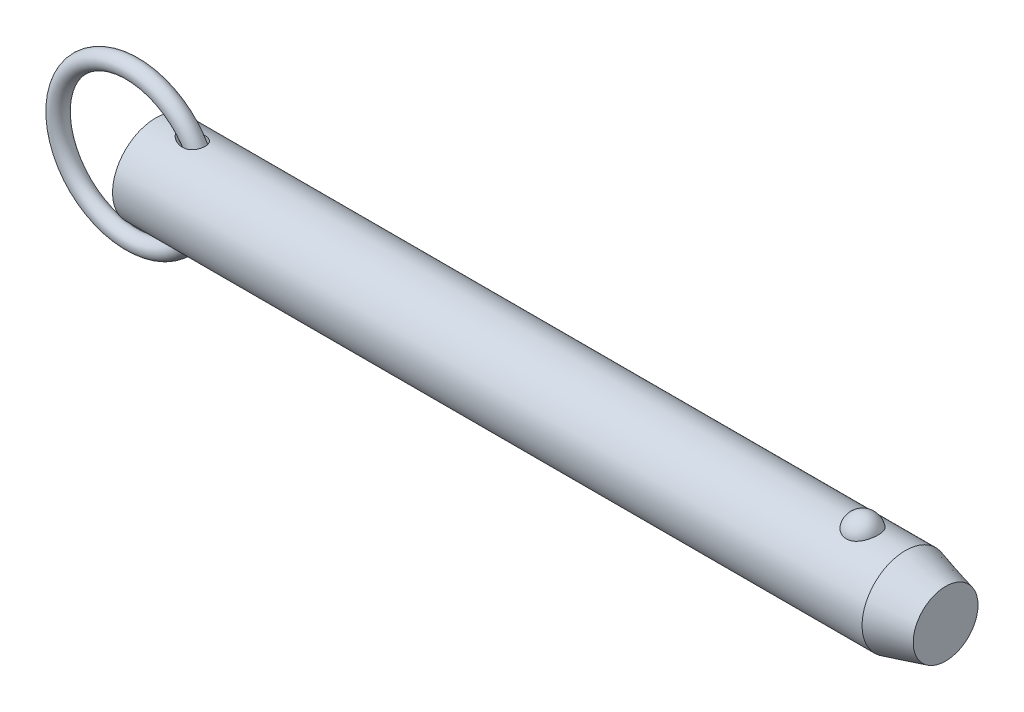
ISO-10303-21;
HEADER;
FILE_DESCRIPTION(('STEP AP214'),'2;1');
FILE_NAME('part.step','',(''),(''),'','','');
FILE_SCHEMA(('AUTOMOTIVE_DESIGN { 1 0 10303 214 1 1 1 1 }'));
ENDSEC;
DATA;
#1=APPLICATION_CONTEXT('core data for automotive mechanical design processes');
#2=APPLICATION_PROTOCOL_DEFINITION('international standard','automotive_design',2000,#1);
#3=PRODUCT_CONTEXT('',#1,'mechanical');
#4=PRODUCT('Part','Part','',(#3));
#5=PRODUCT_RELATED_PRODUCT_CATEGORY('part','',(#4));
#6=PRODUCT_DEFINITION_FORMATION('','',#4);
#7=PRODUCT_DEFINITION_CONTEXT('part definition',#1,'design');
#8=PRODUCT_DEFINITION('design','',#6,#7);
#9=PRODUCT_DEFINITION_SHAPE('','',#8);
#10=(LENGTH_UNIT() NAMED_UNIT(*) SI_UNIT(.MILLI.,.METRE.));
#11=(NAMED_UNIT(*) PLANE_ANGLE_UNIT() SI_UNIT($,.RADIAN.));
#12=(NAMED_UNIT(*) SI_UNIT($,.STERADIAN.) SOLID_ANGLE_UNIT());
#13=UNCERTAINTY_MEASURE_WITH_UNIT(LENGTH_MEASURE(1.E-05),#10,'distance_accuracy_value','');
#14=(GEOMETRIC_REPRESENTATION_CONTEXT(3) GLOBAL_UNCERTAINTY_ASSIGNED_CONTEXT((#13)) GLOBAL_UNIT_ASSIGNED_CONTEXT((#10,
#11,#12)) REPRESENTATION_CONTEXT('',''));
#15=CARTESIAN_POINT('',(0.,0.,0.));
#16=DIRECTION('',(0.,0.,1.));
#17=DIRECTION('',(1.,0.,0.));
#18=AXIS2_PLACEMENT_3D('',#15,#16,#17);
#19=CARTESIAN_POINT('',(-6.08699288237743,0.,0.));
#20=DIRECTION('',(0.,0.,1.));
#21=DIRECTION('',(1.,0.,0.));
#22=AXIS2_PLACEMENT_3D('',#19,#20,#21);
#23=TOROIDAL_SURFACE('',#22,19.05,2.223);
#24=CARTESIAN_POINT('',(15.1860071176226,0.,0.));
#25=VERTEX_POINT('',#24);
#26=VERTEX_LOOP('',#25);
#27=FACE_BOUND('',#26,.T.);
#28=ADVANCED_FACE('P0_F12',(#27),#23,.T.);
#29=CLOSED_SHELL('',(#28));
#30=MANIFOLD_SOLID_BREP('P0_B1',#29);
#31=CARTESIAN_POINT('',(0.,0.,0.));
#32=DIRECTION('',(1.,0.,0.));
#33=DIRECTION('',(0.,0.,-1.));
#34=AXIS2_PLACEMENT_3D('',#31,#32,#33);
#35=CYLINDRICAL_SURFACE('',#34,11.115);
#36=CARTESIAN_POINT('',(6.41405181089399,11.0227946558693,-1.4287136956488));
#37=CARTESIAN_POINT('',(6.49338916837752,11.0115377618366,-1.51556642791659));
#38=CARTESIAN_POINT('',(6.5776546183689,10.9998263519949,-1.59789397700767));
#39=CARTESIAN_POINT('',(6.75386647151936,10.9760304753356,-1.75391400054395));
#40=CARTESIAN_POINT('',(6.84582247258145,10.9639455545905,-1.82759540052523));
#41=CARTESIAN_POINT('',(7.03627827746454,10.9397989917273,-1.96698954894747));
#42=CARTESIAN_POINT('',(7.1348083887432,10.9277377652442,-2.03266078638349));
#43=CARTESIAN_POINT('',(7.33681032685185,10.9041015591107,-2.1558582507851));
#44=CARTESIAN_POINT('',(7.44028007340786,10.8925263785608,-2.21338786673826));
#45=CARTESIAN_POINT('',(7.64386117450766,10.8710104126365,-2.31666528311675));
#46=CARTESIAN_POINT('',(7.74368989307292,10.8610119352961,-2.36295942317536));
#47=CARTESIAN_POINT('',(7.94637195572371,10.8420168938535,-2.44863486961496));
#48=CARTESIAN_POINT('',(8.0492261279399,10.8330206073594,-2.48801426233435));
#49=CARTESIAN_POINT('',(8.3611557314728,10.807980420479,-2.59542730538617));
#50=CARTESIAN_POINT('',(8.57411849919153,10.7938278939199,-2.65299817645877));
#51=CARTESIAN_POINT('',(9.00825016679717,10.7725818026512,-2.73800108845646));
#52=CARTESIAN_POINT('',(9.22947335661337,10.7655491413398,-2.76517330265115));
#53=CARTESIAN_POINT('',(9.6736814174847,10.7605872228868,-2.78445308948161));
#54=CARTESIAN_POINT('',(9.89666486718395,10.7626512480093,-2.77658653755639));
#55=CARTESIAN_POINT('',(10.2950172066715,10.7754452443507,-2.72644436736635));
#56=CARTESIAN_POINT('',(10.4712789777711,10.7844280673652,-2.69109376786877));
#57=CARTESIAN_POINT('',(10.7292776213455,10.8024982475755,-2.61722365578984));
#58=CARTESIAN_POINT('',(10.8142337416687,10.8092901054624,-2.58911576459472));
#59=CARTESIAN_POINT('',(10.9813218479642,10.8242580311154,-2.52581287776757));
#60=CARTESIAN_POINT('',(11.0634550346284,10.8324335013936,-2.49062094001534));
#61=CARTESIAN_POINT('',(11.2247418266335,10.8500287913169,-2.41281958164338));
#62=CARTESIAN_POINT('',(11.3038694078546,10.8594572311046,-2.37015806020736));
#63=CARTESIAN_POINT('',(11.4576781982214,10.8792243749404,-2.27770403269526));
#64=CARTESIAN_POINT('',(11.5323615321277,10.8895626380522,-2.22791497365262));
#65=CARTESIAN_POINT('',(11.6765388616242,10.9108113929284,-2.12140590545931));
#66=CARTESIAN_POINT('',(11.7460329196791,10.9217218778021,-2.06468597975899));
#67=CARTESIAN_POINT('',(11.8790597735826,10.9437207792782,-1.94471764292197));
#68=CARTESIAN_POINT('',(11.9425932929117,10.9548091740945,-1.88147002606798));
#69=CARTESIAN_POINT('',(12.109388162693,10.9851999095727,-1.69784918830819));
#70=CARTESIAN_POINT('',(12.205655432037,11.0042655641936,-1.57093023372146));
#71=CARTESIAN_POINT('',(12.374151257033,11.0393391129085,-1.3017676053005));
#72=CARTESIAN_POINT('',(12.4463875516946,11.0553479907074,-1.15952888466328));
#73=CARTESIAN_POINT('',(12.5615818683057,11.0816338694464,-0.871972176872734));
#74=CARTESIAN_POINT('',(12.6058896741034,11.0921698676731,-0.727217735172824));
#75=CARTESIAN_POINT('',(12.6699315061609,11.1075802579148,-0.432089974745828));
#76=CARTESIAN_POINT('',(12.6896681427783,11.1124552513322,-0.281717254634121));
#77=CARTESIAN_POINT('',(12.704022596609,11.1159901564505,0.0188164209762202));
#78=CARTESIAN_POINT('',(12.6988836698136,11.1147102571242,0.168965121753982));
#79=CARTESIAN_POINT('',(12.6641681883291,11.1062126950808,0.466238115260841));
#80=CARTESIAN_POINT('',(12.6345920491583,11.0989951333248,0.61336245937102));
#81=CARTESIAN_POINT('',(12.5517453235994,11.0794095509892,0.900330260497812));
#82=CARTESIAN_POINT('',(12.4984878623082,11.0670443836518,1.0401777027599));
#83=CARTESIAN_POINT('',(12.3696588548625,11.0385082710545,1.308745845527));
#84=CARTESIAN_POINT('',(12.2940887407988,11.0223375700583,1.43746725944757));
#85=CARTESIAN_POINT('',(12.122380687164,10.987872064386,1.68079704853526));
#86=CARTESIAN_POINT('',(12.0261637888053,10.969569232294,1.79534850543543));
#87=CARTESIAN_POINT('',(11.8161707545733,10.932836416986,2.00695695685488));
#88=CARTESIAN_POINT('',(11.7023941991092,10.9144064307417,2.10401353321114));
#89=CARTESIAN_POINT('',(11.4575656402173,10.8788057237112,2.28105326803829));
#90=CARTESIAN_POINT('',(11.3261451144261,10.8616794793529,2.36053412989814));
#91=CARTESIAN_POINT('',(11.0523589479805,10.8308019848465,2.49839044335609));
#92=CARTESIAN_POINT('',(10.9099908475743,10.8170514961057,2.55676113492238));
#93=CARTESIAN_POINT('',(10.6060622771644,10.7929728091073,2.65666105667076));
#94=CARTESIAN_POINT('',(10.4438877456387,10.7830209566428,2.69640163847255));
#95=CARTESIAN_POINT('',(10.1154037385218,10.7687230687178,2.75293129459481));
#96=CARTESIAN_POINT('',(9.94909141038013,10.7643810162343,2.76970406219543));
#97=CARTESIAN_POINT('',(9.54387061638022,10.7604809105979,2.7848723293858));
#98=CARTESIAN_POINT('',(9.30446860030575,10.7637793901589,2.77227753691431));
#99=CARTESIAN_POINT('',(8.94961255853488,10.7757341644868,2.72524141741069));
#100=CARTESIAN_POINT('',(8.83186896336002,10.7808994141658,2.70482239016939));
#101=CARTESIAN_POINT('',(8.59835142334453,10.7932548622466,2.65509992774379));
#102=CARTESIAN_POINT('',(8.48257728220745,10.8004448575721,2.62579738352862));
#103=CARTESIAN_POINT('',(8.25208469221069,10.8166382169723,2.55827624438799));
#104=CARTESIAN_POINT('',(8.1374021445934,10.8256649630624,2.51994155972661));
#105=CARTESIAN_POINT('',(7.91132058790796,10.8451170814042,2.43486475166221));
#106=CARTESIAN_POINT('',(7.79992154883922,10.8555424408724,2.38812270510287));
#107=CARTESIAN_POINT('',(7.58115677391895,10.8774251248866,2.28638483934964));
#108=CARTESIAN_POINT('',(7.47378802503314,10.8888816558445,2.23139534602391));
#109=CARTESIAN_POINT('',(7.26385624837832,10.9124540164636,2.11310265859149));
#110=CARTESIAN_POINT('',(7.16129168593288,10.9245696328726,2.04980214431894));
#111=CARTESIAN_POINT('',(6.91882218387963,10.9543689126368,1.88540538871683));
#112=CARTESIAN_POINT('',(6.78193778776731,10.9721958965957,1.77979827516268));
#113=CARTESIAN_POINT('',(6.52472441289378,11.0070222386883,1.54989693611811));
#114=CARTESIAN_POINT('',(6.40436902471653,11.0240228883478,1.42563320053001));
#115=CARTESIAN_POINT('',(6.21838804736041,11.0509658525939,1.19529359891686));
#116=CARTESIAN_POINT('',(6.14691885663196,11.0615430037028,1.09404520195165));
#117=CARTESIAN_POINT('',(6.0204349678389,11.0805004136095,0.881508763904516));
#118=CARTESIAN_POINT('',(5.96539400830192,11.0888841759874,0.770237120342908));
#119=CARTESIAN_POINT('',(5.88475453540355,11.1012553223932,0.560577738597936));
#120=CARTESIAN_POINT('',(5.85559643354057,11.1057686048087,0.463603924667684));
#121=CARTESIAN_POINT('',(5.81381299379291,11.1122523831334,0.266083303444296));
#122=CARTESIAN_POINT('',(5.80117118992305,11.1142254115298,0.165540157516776));
#123=CARTESIAN_POINT('',(5.79363815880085,11.1153999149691,-0.0364747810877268));
#124=CARTESIAN_POINT('',(5.79878799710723,11.1145949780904,-0.137948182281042));
#125=CARTESIAN_POINT('',(5.82639592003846,11.1102987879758,-0.338493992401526));
#126=CARTESIAN_POINT('',(5.8488723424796,11.1068046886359,-0.437563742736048));
#127=CARTESIAN_POINT('',(5.91510741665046,11.0965857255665,-0.649968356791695));
#128=CARTESIAN_POINT('',(5.96220905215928,11.0893566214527,-0.7622229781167));
#129=CARTESIAN_POINT('',(6.0737844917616,11.072471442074,-0.977396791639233));
#130=CARTESIAN_POINT('',(6.13826787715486,11.0628140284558,-1.08031079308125));
#131=CARTESIAN_POINT('',(6.24101077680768,11.0477136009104,-1.2219580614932));
#132=CARTESIAN_POINT('',(6.27403486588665,11.042895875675,-1.26469183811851));
#133=CARTESIAN_POINT('',(6.34238022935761,11.0330152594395,-1.34817011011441));
#134=CARTESIAN_POINT('',(6.37769867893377,11.0279526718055,-1.38891694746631));
#135=CARTESIAN_POINT('',(6.41405181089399,11.0227946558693,-1.4287136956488));
#136=B_SPLINE_CURVE_WITH_KNOTS('',3,(#36,#37,#38,#39,#40,#41,#42,#43,#44,#45,#46,#47,#48,#49,
#50,#51,#52,#53,#54,#55,#56,#57,#58,#59,#60,#61,#62,#63,#64,#65,#66,#67,#68,#69,#70,#71,#72,#73,
#74,#75,#76,#77,#78,#79,#80,#81,#82,#83,#84,#85,#86,#87,#88,#89,#90,#91,#92,#93,#94,#95,#96,#97,
#98,#99,#100,#101,#102,#103,#104,#105,#106,#107,#108,#109,#110,#111,#112,#113,#114,#115,#116,
#117,#118,#119,#120,#121,#122,#123,#124,#125,#126,#127,#128,#129,#130,#131,#132,#133,#134,#135),
.UNSPECIFIED.,.T.,.F.,(4,2,2,2,2,2,2,2,2,2,2,2,2,2,2,2,2,2,2,2,2,2,2,2,2,2,2,2,2,2,2,2,2,2,2,2,
2,2,2,2,2,2,2,2,2,2,2,2,2,4),(0.,0.354433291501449,0.709315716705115,1.0659654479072,
1.42246628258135,1.75367157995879,2.08496839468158,2.74582009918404,3.41227815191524,
4.07824412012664,4.61583787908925,4.88478112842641,5.1536085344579,5.42439170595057,
5.69504436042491,5.96569375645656,6.23631025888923,6.71490729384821,7.19335005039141,
7.64641437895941,8.09943057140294,8.54802575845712,8.99661331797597,9.44495256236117,
9.89326303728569,10.3433195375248,10.7933867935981,11.2550086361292,11.7167345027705,
12.2165866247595,12.7167934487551,13.4318876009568,13.7904664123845,14.1490092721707,
14.5124394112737,14.8758662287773,15.239015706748,15.6020483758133,16.1219860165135,
16.6410830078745,17.0130520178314,17.3844231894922,17.6872330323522,17.9897407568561,
18.2929471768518,18.5964749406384,18.9603532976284,19.3244326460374,19.4870338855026,
19.649438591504),.UNSPECIFIED.);
#137=CARTESIAN_POINT('',(6.41405181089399,11.0227946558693,-1.4287136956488));
#138=VERTEX_POINT('',#137);
#139=EDGE_CURVE('P1_E40',#138,#138,#136,.T.);
#140=ORIENTED_EDGE('',*,*,#139,.T.);
#141=EDGE_LOOP('',(#140));
#142=FACE_BOUND('',#141,.T.);
#143=CARTESIAN_POINT('',(192.829563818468,0.,0.));
#144=DIRECTION('',(1.,0.,0.));
#145=DIRECTION('',(0.,0.,-1.));
#146=AXIS2_PLACEMENT_3D('',#143,#144,#145);
#147=CIRCLE('',#146,11.115);
#148=CARTESIAN_POINT('',(192.829563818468,0.,-11.115));
#149=VERTEX_POINT('',#148);
#150=EDGE_CURVE('P1_E25',#149,#149,#147,.T.);
#151=ORIENTED_EDGE('',*,*,#150,.F.);
#152=EDGE_LOOP('',(#151));
#153=FACE_BOUND('',#152,.T.);
#154=CARTESIAN_POINT('',(0.,0.,0.));
#155=DIRECTION('',(1.,0.,0.));
#156=DIRECTION('',(0.,0.,-1.));
#157=AXIS2_PLACEMENT_3D('',#154,#155,#156);
#158=CIRCLE('',#157,11.115);
#159=CARTESIAN_POINT('',(0.,0.,-11.115));
#160=VERTEX_POINT('',#159);
#161=EDGE_CURVE('P1_E9',#160,#160,#158,.T.);
#162=ORIENTED_EDGE('',*,*,#161,.T.);
#163=EDGE_LOOP('',(#162));
#164=FACE_BOUND('',#163,.T.);
#165=CARTESIAN_POINT('',(181.831068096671,10.3028087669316,4.17077409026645));
#166=CARTESIAN_POINT('',(181.614775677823,10.3028003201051,4.17078240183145));
#167=CARTESIAN_POINT('',(181.398548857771,10.3098895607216,4.15340593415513));
#168=CARTESIAN_POINT('',(180.972540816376,10.3373834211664,4.08449540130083));
#169=CARTESIAN_POINT('',(180.762757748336,10.3577841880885,4.0329712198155));
#170=CARTESIAN_POINT('',(180.355782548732,10.4095237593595,3.89746513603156));
#171=CARTESIAN_POINT('',(180.158572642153,10.4408466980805,3.81353029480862));
#172=CARTESIAN_POINT('',(179.781338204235,10.5110236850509,3.61560339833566));
#173=CARTESIAN_POINT('',(179.601317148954,10.5498792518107,3.50160528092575));
#174=CARTESIAN_POINT('',(179.257684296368,10.6322884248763,3.24292464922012));
#175=CARTESIAN_POINT('',(179.094686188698,10.6759443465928,3.0974604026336));
#176=CARTESIAN_POINT('',(178.794591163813,10.7625291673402,2.78171925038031));
#177=CARTESIAN_POINT('',(178.657499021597,10.8054579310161,2.61143778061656));
#178=CARTESIAN_POINT('',(178.406408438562,10.8881935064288,2.24226695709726));
#179=CARTESIAN_POINT('',(178.293710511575,10.9277761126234,2.04244123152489));
#180=CARTESIAN_POINT('',(178.101777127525,10.997484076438,1.62578254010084));
#181=CARTESIAN_POINT('',(178.022544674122,11.0276085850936,1.40894804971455));
#182=CARTESIAN_POINT('',(177.898303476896,11.0756732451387,0.961250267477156));
#183=CARTESIAN_POINT('',(177.853760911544,11.0934470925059,0.730239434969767));
#184=CARTESIAN_POINT('',(177.801569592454,11.1143331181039,0.26343964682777));
#185=CARTESIAN_POINT('',(177.793920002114,11.1174456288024,0.0276507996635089));
#186=CARTESIAN_POINT('',(177.81561056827,11.1087161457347,-0.440729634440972));
#187=CARTESIAN_POINT('',(177.844762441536,11.0969502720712,-0.6733313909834));
#188=CARTESIAN_POINT('',(177.939143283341,11.0597872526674,-1.12996621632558));
#189=CARTESIAN_POINT('',(178.004372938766,11.0343898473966,-1.35399912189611));
#190=CARTESIAN_POINT('',(178.16969844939,10.972515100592,-1.78750286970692));
#191=CARTESIAN_POINT('',(178.26983863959,10.9360236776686,-1.99695478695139));
#192=CARTESIAN_POINT('',(178.502940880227,10.8557595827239,-2.3952066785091));
#193=CARTESIAN_POINT('',(178.635905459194,10.8119863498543,-2.5840050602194));
#194=CARTESIAN_POINT('',(178.932407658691,10.7216733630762,-2.93635726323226));
#195=CARTESIAN_POINT('',(179.096056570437,10.675123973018,-3.09981510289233));
#196=CARTESIAN_POINT('',(179.449860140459,10.5846571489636,-3.39592247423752));
#197=CARTESIAN_POINT('',(179.640012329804,10.5407394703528,-3.52857487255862));
#198=CARTESIAN_POINT('',(180.03750141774,10.4616690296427,-3.75646057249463));
#199=CARTESIAN_POINT('',(180.24436705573,10.4263443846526,-3.85245432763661));
#200=CARTESIAN_POINT('',(180.672954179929,10.3675574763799,-4.00798747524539));
#201=CARTESIAN_POINT('',(180.894670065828,10.344090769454,-4.0675405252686));
#202=CARTESIAN_POINT('',(181.334669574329,10.3128282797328,-4.14614314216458));
#203=CARTESIAN_POINT('',(181.552565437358,10.3043040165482,-4.1670783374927));
#204=CARTESIAN_POINT('',(181.98894951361,10.3016771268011,-4.17357158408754));
#205=CARTESIAN_POINT('',(182.207437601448,10.3075716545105,-4.15913661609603));
#206=CARTESIAN_POINT('',(182.631744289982,10.3326686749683,-4.09636961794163));
#207=CARTESIAN_POINT('',(182.837745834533,10.3514555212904,-4.0490957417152));
#208=CARTESIAN_POINT('',(183.238576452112,10.399818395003,-3.92320197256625));
#209=CARTESIAN_POINT('',(183.4334046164,10.4293952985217,-3.84457953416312));
#210=CARTESIAN_POINT('',(183.811191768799,10.4969600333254,-3.65612410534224));
#211=CARTESIAN_POINT('',(183.993797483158,10.5351178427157,-3.54564545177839));
#212=CARTESIAN_POINT('',(184.338204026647,10.6154999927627,-3.29718036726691));
#213=CARTESIAN_POINT('',(184.500000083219,10.657725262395,-3.15918764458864));
#214=CARTESIAN_POINT('',(184.806959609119,10.744212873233,-2.85163580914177));
#215=CARTESIAN_POINT('',(184.950891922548,10.7884718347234,-2.68084605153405));
#216=CARTESIAN_POINT('',(185.209237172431,10.872374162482,-2.31721864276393));
#217=CARTESIAN_POINT('',(185.323644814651,10.9120167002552,-2.12437704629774));
#218=CARTESIAN_POINT('',(185.523873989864,10.9838919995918,-1.71516999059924));
#219=CARTESIAN_POINT('',(185.60866178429,11.0158465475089,-1.49824866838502));
#220=CARTESIAN_POINT('',(185.74268382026,11.0673523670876,-1.05228572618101));
#221=CARTESIAN_POINT('',(185.791917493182,11.086903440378,-0.823243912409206));
#222=CARTESIAN_POINT('',(185.853891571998,11.1116323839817,-0.359087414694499));
#223=CARTESIAN_POINT('',(185.866566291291,11.1167843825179,-0.123962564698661));
#224=CARTESIAN_POINT('',(185.854973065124,11.1121144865,0.345220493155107));
#225=CARTESIAN_POINT('',(185.830705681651,11.1022928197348,0.57927871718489));
#226=CARTESIAN_POINT('',(185.745907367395,11.0687504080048,1.03866534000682));
#227=CARTESIAN_POINT('',(185.685529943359,11.0450885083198,1.26402641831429));
#228=CARTESIAN_POINT('',(185.529853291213,10.9863185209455,1.70076772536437));
#229=CARTESIAN_POINT('',(185.434551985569,10.9512097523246,1.91214712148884));
#230=CARTESIAN_POINT('',(185.210397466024,10.8729733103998,2.316083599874));
#231=CARTESIAN_POINT('',(185.081380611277,10.8298068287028,2.50854240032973));
#232=CARTESIAN_POINT('',(184.792732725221,10.7401896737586,2.86808766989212));
#233=CARTESIAN_POINT('',(184.633102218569,10.6937390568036,3.03517457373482));
#234=CARTESIAN_POINT('',(184.287534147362,10.6029321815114,3.33857581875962));
#235=CARTESIAN_POINT('',(184.101708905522,10.5585680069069,3.47501541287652));
#236=CARTESIAN_POINT('',(183.707875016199,10.4769321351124,3.71390897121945));
#237=CARTESIAN_POINT('',(183.499863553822,10.439661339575,3.81635861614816));
#238=CARTESIAN_POINT('',(183.054066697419,10.3749407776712,3.98910631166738));
#239=CARTESIAN_POINT('',(182.815234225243,10.3482457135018,4.05700929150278));
#240=CARTESIAN_POINT('',(182.327925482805,10.312188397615,4.14782844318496));
#241=CARTESIAN_POINT('',(182.079453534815,10.3028184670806,4.17076454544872));
#242=CARTESIAN_POINT('',(181.831068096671,10.3028087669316,4.17077409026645));
#243=B_SPLINE_CURVE_WITH_KNOTS('',3,(#165,#166,#167,#168,#169,#170,#171,#172,#173,#174,#175,
#176,#177,#178,#179,#180,#181,#182,#183,#184,#185,#186,#187,#188,#189,#190,#191,#192,#193,#194,
#195,#196,#197,#198,#199,#200,#201,#202,#203,#204,#205,#206,#207,#208,#209,#210,#211,#212,#213,
#214,#215,#216,#217,#218,#219,#220,#221,#222,#223,#224,#225,#226,#227,#228,#229,#230,#231,#232,
#233,#234,#235,#236,#237,#238,#239,#240,#241,#242),.UNSPECIFIED.,.T.,.F.,(4,2,2,2,2,2,2,2,2,2,2,
2,2,2,2,2,2,2,2,2,2,2,2,2,2,2,2,2,2,2,2,2,2,2,2,2,2,2,4),(0.,0.64796614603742,1.29574482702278,
1.9425864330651,2.58955857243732,3.25496465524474,3.92049326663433,4.61566368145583,
5.31089647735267,6.01531821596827,6.71972398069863,7.42054043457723,8.12137023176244,
8.82309331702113,9.5248704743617,10.2292439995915,10.9335519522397,11.6223330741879,
12.3108558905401,12.9647664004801,13.6185478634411,14.252184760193,14.8858731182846,
15.5334360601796,16.1811472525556,16.8611459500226,17.5412664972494,18.2431855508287,
18.9451158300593,19.6483065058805,20.3514864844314,21.0516982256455,21.7519516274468,
22.4556690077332,23.1593743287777,23.860149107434,24.5610129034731,25.3054529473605,
26.049562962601),.UNSPECIFIED.);
#244=CARTESIAN_POINT('',(181.831068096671,10.3028087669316,4.17077409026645));
#245=VERTEX_POINT('',#244);
#246=EDGE_CURVE('P1_E34',#245,#245,#243,.T.);
#247=ORIENTED_EDGE('',*,*,#246,.T.);
#248=EDGE_LOOP('',(#247));
#249=FACE_BOUND('',#248,.T.);
#250=CARTESIAN_POINT('',(6.41405181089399,-11.0227946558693,-1.4287136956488));
#251=CARTESIAN_POINT('',(6.3312406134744,-11.0345445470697,-1.33806125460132));
#252=CARTESIAN_POINT('',(6.25372866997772,-11.0458090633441,-1.24240732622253));
#253=CARTESIAN_POINT('',(6.11277905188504,-11.0666115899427,-1.04095704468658));
#254=CARTESIAN_POINT('',(6.04933920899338,-11.0761498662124,-0.935162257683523));
#255=CARTESIAN_POINT('',(5.94029181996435,-11.0927063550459,-0.712476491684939));
#256=CARTESIAN_POINT('',(5.89492964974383,-11.0996897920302,-0.595457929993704));
#257=CARTESIAN_POINT('',(5.84498161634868,-11.1074141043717,-0.414997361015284));
#258=CARTESIAN_POINT('',(5.83135004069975,-11.1095300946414,-0.354047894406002));
#259=CARTESIAN_POINT('',(5.81051649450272,-11.1127688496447,-0.231041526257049));
#260=CARTESIAN_POINT('',(5.80331311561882,-11.1138918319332,-0.1689848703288));
#261=CARTESIAN_POINT('',(5.7929652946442,-11.1155042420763,-0.000484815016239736));
#262=CARTESIAN_POINT('',(5.79625267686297,-11.1149904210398,0.106437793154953));
#263=CARTESIAN_POINT('',(5.82213676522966,-11.1109609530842,0.317809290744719));
#264=CARTESIAN_POINT('',(5.84474662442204,-11.1074432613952,0.422256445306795));
#265=CARTESIAN_POINT('',(5.911131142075,-11.097197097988,0.63936180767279));
#266=CARTESIAN_POINT('',(5.95733120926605,-11.090102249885,0.751250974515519));
#267=CARTESIAN_POINT('',(6.06709542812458,-11.0734770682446,0.965912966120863));
#268=CARTESIAN_POINT('',(6.13068735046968,-11.06394284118,1.06867085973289));
#269=CARTESIAN_POINT('',(6.30294237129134,-11.0385920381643,1.30890635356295));
#270=CARTESIAN_POINT('',(6.41896200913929,-11.0218881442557,1.44097376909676));
#271=CARTESIAN_POINT('',(6.66989654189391,-10.9871512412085,1.68553954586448));
#272=CARTESIAN_POINT('',(6.80485520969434,-10.9691152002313,1.79799117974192));
#273=CARTESIAN_POINT('',(7.04881236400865,-10.9382283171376,1.97587596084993));
#274=CARTESIAN_POINT('',(7.15465712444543,-10.9253240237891,2.04570822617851));
#275=CARTESIAN_POINT('',(7.37202504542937,-10.9000987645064,2.17611840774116));
#276=CARTESIAN_POINT('',(7.48355057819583,-10.8877780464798,2.23669241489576));
#277=CARTESIAN_POINT('',(7.71132418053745,-10.8641580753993,2.34873831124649));
#278=CARTESIAN_POINT('',(7.82757727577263,-10.8528599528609,2.40020018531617));
#279=CARTESIAN_POINT('',(8.06386825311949,-10.8317234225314,2.49385169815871));
#280=CARTESIAN_POINT('',(8.18390558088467,-10.8218848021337,2.53604268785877));
#281=CARTESIAN_POINT('',(8.42918336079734,-10.8039208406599,2.61152283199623));
#282=CARTESIAN_POINT('',(8.55447802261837,-10.7958283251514,2.64464414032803));
#283=CARTESIAN_POINT('',(8.8075212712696,-10.781995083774,2.70048793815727));
#284=CARTESIAN_POINT('',(8.93527019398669,-10.7762546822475,2.72320899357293));
#285=CARTESIAN_POINT('',(9.19210176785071,-10.7675291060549,2.75750994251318));
#286=CARTESIAN_POINT('',(9.32118105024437,-10.7645381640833,2.76911315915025));
#287=CARTESIAN_POINT('',(9.57984338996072,-10.761622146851,2.78042035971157));
#288=CARTESIAN_POINT('',(9.70942621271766,-10.7616957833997,2.78012934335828));
#289=CARTESIAN_POINT('',(10.0243125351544,-10.7659059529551,2.76381534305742));
#290=CARTESIAN_POINT('',(10.209307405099,-10.7717977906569,2.74099674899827));
#291=CARTESIAN_POINT('',(10.5731188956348,-10.7905408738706,2.66626238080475));
#292=CARTESIAN_POINT('',(10.7519389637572,-10.8033881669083,2.61436313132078));
#293=CARTESIAN_POINT('',(11.0114289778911,-10.8271584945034,2.51336808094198));
#294=CARTESIAN_POINT('',(11.096831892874,-10.835881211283,2.47562331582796));
#295=CARTESIAN_POINT('',(11.2636000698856,-10.8545688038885,2.39236170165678));
#296=CARTESIAN_POINT('',(11.3449673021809,-10.8645330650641,2.3468486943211));
#297=CARTESIAN_POINT('',(11.5027832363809,-10.8853818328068,2.24815967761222));
#298=CARTESIAN_POINT('',(11.5792327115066,-10.8962661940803,2.19498487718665));
#299=CARTESIAN_POINT('',(11.7263315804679,-10.9185541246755,2.08128855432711));
#300=CARTESIAN_POINT('',(11.7969818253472,-10.9299576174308,2.02076811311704));
#301=CARTESIAN_POINT('',(11.9817953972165,-10.9613645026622,1.84513663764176));
#302=CARTESIAN_POINT('',(12.0893012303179,-10.9814643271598,1.72286660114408));
#303=CARTESIAN_POINT('',(12.2803576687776,-11.0193991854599,1.46066991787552));
#304=CARTESIAN_POINT('',(12.3639173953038,-11.0372350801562,1.3207500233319));
#305=CARTESIAN_POINT('',(12.4996220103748,-11.0672969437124,1.03778067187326));
#306=CARTESIAN_POINT('',(12.5535315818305,-11.0798242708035,0.895607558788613));
#307=CARTESIAN_POINT('',(12.636874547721,-11.0995427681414,0.603918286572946));
#308=CARTESIAN_POINT('',(12.6663115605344,-11.1067347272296,0.454403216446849));
#309=CARTESIAN_POINT('',(12.6997387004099,-11.1149224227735,0.154577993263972));
#310=CARTESIAN_POINT('',(12.7040886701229,-11.1160057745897,0.00431019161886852));
#311=CARTESIAN_POINT('',(12.6882048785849,-11.1120956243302,-0.294841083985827));
#312=CARTESIAN_POINT('',(12.6679715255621,-11.1071022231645,-0.443724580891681));
#313=CARTESIAN_POINT('',(12.6034470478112,-11.0915888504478,-0.735688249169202));
#314=CARTESIAN_POINT('',(12.5591858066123,-11.0810757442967,-0.878775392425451));
#315=CARTESIAN_POINT('',(12.4477416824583,-11.0556687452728,-1.15529525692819));
#316=CARTESIAN_POINT('',(12.3805601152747,-11.0407751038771,-1.2887285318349));
#317=CARTESIAN_POINT('',(12.2248919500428,-11.0081839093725,-1.54257976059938));
#318=CARTESIAN_POINT('',(12.1363549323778,-10.9904797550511,-1.66296592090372));
#319=CARTESIAN_POINT('',(11.9406137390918,-10.9541951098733,-1.88726577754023));
#320=CARTESIAN_POINT('',(11.833409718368,-10.9356146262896,-1.99117961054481));
#321=CARTESIAN_POINT('',(11.601318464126,-10.8991360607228,-2.18213646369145));
#322=CARTESIAN_POINT('',(11.4761325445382,-10.8812577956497,-2.26881927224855));
#323=CARTESIAN_POINT('',(11.2134852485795,-10.8482871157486,-2.42157282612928));
#324=CARTESIAN_POINT('',(11.0760218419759,-10.8331951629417,-2.48764015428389));
#325=CARTESIAN_POINT('',(10.7828968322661,-10.8061050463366,-2.60290068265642));
#326=CARTESIAN_POINT('',(10.6266338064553,-10.7943907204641,-2.65062248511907));
#327=CARTESIAN_POINT('',(10.3086617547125,-10.7762429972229,-2.72345054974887));
#328=CARTESIAN_POINT('',(10.146948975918,-10.7698133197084,-2.74854088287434));
#329=CARTESIAN_POINT('',(9.75541304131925,-10.7608036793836,-2.78368719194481));
#330=CARTESIAN_POINT('',(9.52459435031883,-10.7608467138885,-2.78350276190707));
#331=CARTESIAN_POINT('',(9.0660496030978,-10.7702674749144,-2.74677945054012));
#332=CARTESIAN_POINT('',(8.83832966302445,-10.7796615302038,-2.71017697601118));
#333=CARTESIAN_POINT('',(8.38783466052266,-10.8058248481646,-2.60392490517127));
#334=CARTESIAN_POINT('',(8.16517101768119,-10.8226939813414,-2.53382676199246));
#335=CARTESIAN_POINT('',(7.84087311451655,-10.8516548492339,-2.40555545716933));
#336=CARTESIAN_POINT('',(7.73435551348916,-10.8619221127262,-2.35892455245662));
#337=CARTESIAN_POINT('',(7.52510420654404,-10.883357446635,-2.25797017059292));
#338=CARTESIAN_POINT('',(7.42236986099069,-10.8945253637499,-2.20364800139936));
#339=CARTESIAN_POINT('',(7.23808758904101,-10.915528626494,-2.09688018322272));
#340=CARTESIAN_POINT('',(7.15584631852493,-10.9252787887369,-2.04561072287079));
#341=CARTESIAN_POINT('',(6.99510576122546,-10.944960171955,-1.93754729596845));
#342=CARTESIAN_POINT('',(6.91660574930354,-10.9548913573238,-1.88075440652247));
#343=CARTESIAN_POINT('',(6.76418133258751,-10.974690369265,-1.7615450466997));
#344=CARTESIAN_POINT('',(6.69024940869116,-10.984558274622,-1.69913825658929));
#345=CARTESIAN_POINT('',(6.54780119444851,-11.0039826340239,-1.56842485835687));
#346=CARTESIAN_POINT('',(6.47928247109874,-11.0135392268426,-1.50012092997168));
#347=CARTESIAN_POINT('',(6.41405181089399,-11.0227946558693,-1.4287136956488));
#348=B_SPLINE_CURVE_WITH_KNOTS('',3,(#250,#251,#252,#253,#254,#255,#256,#257,#258,#259,#260,
#261,#262,#263,#264,#265,#266,#267,#268,#269,#270,#271,#272,#273,#274,#275,#276,#277,#278,#279,
#280,#281,#282,#283,#284,#285,#286,#287,#288,#289,#290,#291,#292,#293,#294,#295,#296,#297,#298,
#299,#300,#301,#302,#303,#304,#305,#306,#307,#308,#309,#310,#311,#312,#313,#314,#315,#316,#317,
#318,#319,#320,#321,#322,#323,#324,#325,#326,#327,#328,#329,#330,#331,#332,#333,#334,#335,#336,
#337,#338,#339,#340,#341,#342,#343,#344,#345,#346,#347),.UNSPECIFIED.,.T.,.F.,(4,2,2,2,2,2,2,2,
2,2,2,2,2,2,2,2,2,2,2,2,2,2,2,2,2,2,2,2,2,2,2,2,2,2,2,2,2,2,2,2,2,2,2,2,2,2,2,2,4),(0.,
0.36983565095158,0.739614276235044,1.1142538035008,1.30141910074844,1.48854338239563,
1.8074587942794,2.12659146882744,2.4883888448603,2.85076733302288,3.3776216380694,
3.90571433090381,4.287639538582,4.66972556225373,5.05222896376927,5.43467659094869,
5.82378546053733,6.21294796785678,6.6012922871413,6.98947336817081,7.54669558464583,
8.10360148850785,8.38458539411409,8.66543074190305,8.94623182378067,9.22699162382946,
9.7162888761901,10.2053995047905,10.6608871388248,11.1163074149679,11.5651786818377,
12.0140424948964,12.4623493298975,12.9106304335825,13.3599804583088,13.8093267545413,
14.2672570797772,14.7252632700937,15.214740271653,15.7045615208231,16.3932594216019,
17.083162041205,17.7825738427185,18.1325177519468,18.4824022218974,18.7744056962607,
19.0663523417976,19.3578048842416,19.6491256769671),.UNSPECIFIED.);
#349=CARTESIAN_POINT('',(6.41405181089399,-11.0227946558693,-1.4287136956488));
#350=VERTEX_POINT('',#349);
#351=EDGE_CURVE('P1_E17',#350,#350,#348,.T.);
#352=ORIENTED_EDGE('',*,*,#351,.T.);
#353=EDGE_LOOP('',(#352));
#354=FACE_BOUND('',#353,.T.);
#355=ADVANCED_FACE('P1_F13',(#142,#153,#164,#249,#354),#35,.T.);
#356=CARTESIAN_POINT('',(0.,0.,0.));
#357=DIRECTION('',(-1.,0.,0.));
#358=DIRECTION('',(0.,0.,1.));
#359=AXIS2_PLACEMENT_3D('',#356,#357,#358);
#360=PLANE('',#359);
#361=ORIENTED_EDGE('',*,*,#161,.F.);
#362=EDGE_LOOP('',(#361));
#363=FACE_BOUND('',#362,.T.);
#364=ADVANCED_FACE('P1_F15',(#363),#360,.T.);
#365=CARTESIAN_POINT('',(203.2,0.,0.));
#366=DIRECTION('',(-1.,0.,0.));
#367=DIRECTION('',(0.,0.,1.));
#368=AXIS2_PLACEMENT_3D('',#365,#366,#367);
#369=CONICAL_SURFACE('',#368,8.33625000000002,0.261799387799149);
#370=ORIENTED_EDGE('',*,*,#150,.T.);
#371=EDGE_LOOP('',(#370));
#372=FACE_BOUND('',#371,.T.);
#373=CARTESIAN_POINT('',(203.2,0.,0.));
#374=DIRECTION('',(1.,0.,0.));
#375=DIRECTION('',(0.,0.,-1.));
#376=AXIS2_PLACEMENT_3D('',#373,#374,#375);
#377=CIRCLE('',#376,8.33625000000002);
#378=CARTESIAN_POINT('',(203.2,0.,-8.33625000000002));
#379=VERTEX_POINT('',#378);
#380=EDGE_CURVE('P1_E30',#379,#379,#377,.T.);
#381=ORIENTED_EDGE('',*,*,#380,.F.);
#382=EDGE_LOOP('',(#381));
#383=FACE_BOUND('',#382,.T.);
#384=ADVANCED_FACE('P1_F55',(#372,#383),#369,.T.);
#385=CARTESIAN_POINT('',(203.2,8.33625000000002,0.));
#386=DIRECTION('',(1.,0.,0.));
#387=DIRECTION('',(0.,0.,-1.));
#388=AXIS2_PLACEMENT_3D('',#385,#386,#387);
#389=PLANE('',#388);
#390=ORIENTED_EDGE('',*,*,#380,.T.);
#391=EDGE_LOOP('',(#390));
#392=FACE_BOUND('',#391,.T.);
#393=ADVANCED_FACE('P1_F51',(#392),#389,.T.);
#394=CARTESIAN_POINT('',(181.831068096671,10.0035,0.));
#395=DIRECTION('',(-1.,0.,0.));
#396=DIRECTION('',(0.,1.,0.));
#397=AXIS2_PLACEMENT_3D('',#394,#395,#396);
#398=SPHERICAL_SURFACE('',#397,4.18150000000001);
#399=ORIENTED_EDGE('',*,*,#246,.F.);
#400=EDGE_LOOP('',(#399));
#401=FACE_BOUND('',#400,.T.);
#402=ADVANCED_FACE('P1_F46',(#401),#398,.T.);
#403=CARTESIAN_POINT('',(-6.08699288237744,0.,0.));
#404=DIRECTION('',(0.,0.,1.));
#405=DIRECTION('',(1.,0.,0.));
#406=AXIS2_PLACEMENT_3D('',#403,#404,#405);
#407=TOROIDAL_SURFACE('',#406,19.05,2.77875);
#408=ORIENTED_EDGE('',*,*,#351,.F.);
#409=EDGE_LOOP('',(#408));
#410=FACE_BOUND('',#409,.T.);
#411=ORIENTED_EDGE('',*,*,#139,.F.);
#412=EDGE_LOOP('',(#411));
#413=FACE_BOUND('',#412,.T.);
#414=ADVANCED_FACE('P1_F50',(#410,#413),#407,.F.);
#415=CLOSED_SHELL('',(#355,#364,#384,#393,#402,#414));
#416=MANIFOLD_SOLID_BREP('P1_B1',#415);
#417=ADVANCED_BREP_SHAPE_REPRESENTATION('',(#18,#30,#416),#14);
#418=SHAPE_DEFINITION_REPRESENTATION(#9,#417);
ENDSEC;
END-ISO-10303-21;
